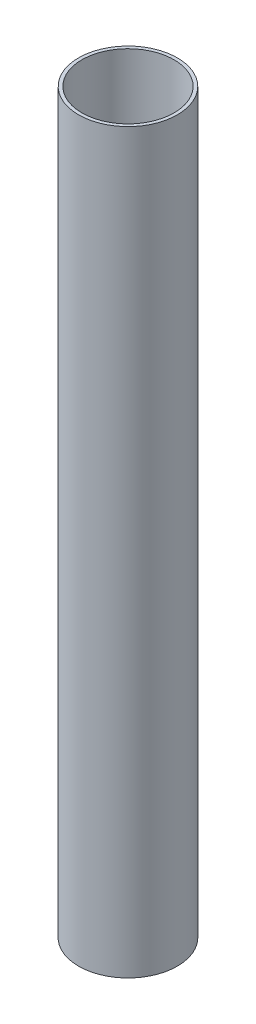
ISO-10303-21;
HEADER;
FILE_DESCRIPTION(('STEP AP214'),'2;1');
FILE_NAME('part.step','',(''),(''),'','','');
FILE_SCHEMA(('AUTOMOTIVE_DESIGN { 1 0 10303 214 1 1 1 1 }'));
ENDSEC;
DATA;
#1=APPLICATION_CONTEXT('core data for automotive mechanical design processes');
#2=APPLICATION_PROTOCOL_DEFINITION('international standard','automotive_design',2000,#1);
#3=PRODUCT_CONTEXT('',#1,'mechanical');
#4=PRODUCT('Part','Part','',(#3));
#5=PRODUCT_RELATED_PRODUCT_CATEGORY('part','',(#4));
#6=PRODUCT_DEFINITION_FORMATION('','',#4);
#7=PRODUCT_DEFINITION_CONTEXT('part definition',#1,'design');
#8=PRODUCT_DEFINITION('design','',#6,#7);
#9=PRODUCT_DEFINITION_SHAPE('','',#8);
#10=(LENGTH_UNIT() NAMED_UNIT(*) SI_UNIT(.MILLI.,.METRE.));
#11=(NAMED_UNIT(*) PLANE_ANGLE_UNIT() SI_UNIT($,.RADIAN.));
#12=(NAMED_UNIT(*) SI_UNIT($,.STERADIAN.) SOLID_ANGLE_UNIT());
#13=UNCERTAINTY_MEASURE_WITH_UNIT(LENGTH_MEASURE(1.E-05),#10,'distance_accuracy_value','');
#14=(GEOMETRIC_REPRESENTATION_CONTEXT(3) GLOBAL_UNCERTAINTY_ASSIGNED_CONTEXT((#13)) GLOBAL_UNIT_ASSIGNED_CONTEXT((#10,
#11,#12)) REPRESENTATION_CONTEXT('',''));
#15=CARTESIAN_POINT('',(0.,0.,0.));
#16=DIRECTION('',(0.,0.,1.));
#17=DIRECTION('',(1.,0.,0.));
#18=AXIS2_PLACEMENT_3D('',#15,#16,#17);
#19=CARTESIAN_POINT('',(0.,711.2,0.));
#20=DIRECTION('',(0.,1.,0.));
#21=DIRECTION('',(0.,0.,1.));
#22=AXIS2_PLACEMENT_3D('',#19,#20,#21);
#23=PLANE('',#22);
#24=CARTESIAN_POINT('',(0.,711.2,0.));
#25=DIRECTION('',(0.,1.,0.));
#26=DIRECTION('',(0.,0.,1.));
#27=AXIS2_PLACEMENT_3D('',#24,#25,#26);
#28=CIRCLE('',#27,47.625);
#29=CARTESIAN_POINT('',(0.,711.2,47.625));
#30=VERTEX_POINT('',#29);
#31=EDGE_CURVE('E10',#30,#30,#28,.T.);
#32=ORIENTED_EDGE('',*,*,#31,.T.);
#33=EDGE_LOOP('',(#32));
#34=FACE_BOUND('',#33,.T.);
#35=CARTESIAN_POINT('',(0.,711.2,0.));
#36=DIRECTION('',(0.,1.,0.));
#37=DIRECTION('',(0.,0.,1.));
#38=AXIS2_PLACEMENT_3D('',#35,#36,#37);
#39=CIRCLE('',#38,44.45);
#40=CARTESIAN_POINT('',(0.,711.2,44.45));
#41=VERTEX_POINT('',#40);
#42=EDGE_CURVE('E41',#41,#41,#39,.T.);
#43=ORIENTED_EDGE('',*,*,#42,.F.);
#44=EDGE_LOOP('',(#43));
#45=FACE_BOUND('',#44,.T.);
#46=ADVANCED_FACE('F30',(#34,#45),#23,.T.);
#47=CARTESIAN_POINT('',(0.,0.,0.));
#48=DIRECTION('',(0.,1.,0.));
#49=DIRECTION('',(0.,0.,1.));
#50=AXIS2_PLACEMENT_3D('',#47,#48,#49);
#51=PLANE('',#50);
#52=CARTESIAN_POINT('',(0.,0.,0.));
#53=DIRECTION('',(0.,1.,0.));
#54=DIRECTION('',(0.,0.,1.));
#55=AXIS2_PLACEMENT_3D('',#52,#53,#54);
#56=CIRCLE('',#55,47.625);
#57=CARTESIAN_POINT('',(0.,0.,47.625));
#58=VERTEX_POINT('',#57);
#59=EDGE_CURVE('E34',#58,#58,#56,.T.);
#60=ORIENTED_EDGE('',*,*,#59,.F.);
#61=EDGE_LOOP('',(#60));
#62=FACE_BOUND('',#61,.T.);
#63=CARTESIAN_POINT('',(0.,0.,0.));
#64=DIRECTION('',(0.,1.,0.));
#65=DIRECTION('',(0.,0.,1.));
#66=AXIS2_PLACEMENT_3D('',#63,#64,#65);
#67=CIRCLE('',#66,44.45);
#68=CARTESIAN_POINT('',(0.,0.,44.45));
#69=VERTEX_POINT('',#68);
#70=EDGE_CURVE('E43',#69,#69,#67,.T.);
#71=ORIENTED_EDGE('',*,*,#70,.T.);
#72=EDGE_LOOP('',(#71));
#73=FACE_BOUND('',#72,.T.);
#74=ADVANCED_FACE('F53',(#62,#73),#51,.F.);
#75=CARTESIAN_POINT('',(0.,711.2,0.));
#76=DIRECTION('',(0.,-1.,0.));
#77=DIRECTION('',(0.,0.,-1.));
#78=AXIS2_PLACEMENT_3D('',#75,#76,#77);
#79=CYLINDRICAL_SURFACE('',#78,47.625);
#80=ORIENTED_EDGE('',*,*,#31,.F.);
#81=EDGE_LOOP('',(#80));
#82=FACE_BOUND('',#81,.T.);
#83=ORIENTED_EDGE('',*,*,#59,.T.);
#84=EDGE_LOOP('',(#83));
#85=FACE_BOUND('',#84,.T.);
#86=ADVANCED_FACE('F32',(#82,#85),#79,.T.);
#87=CARTESIAN_POINT('',(0.,711.2,0.));
#88=DIRECTION('',(0.,-1.,0.));
#89=DIRECTION('',(0.,0.,-1.));
#90=AXIS2_PLACEMENT_3D('',#87,#88,#89);
#91=CYLINDRICAL_SURFACE('',#90,44.45);
#92=ORIENTED_EDGE('',*,*,#42,.T.);
#93=EDGE_LOOP('',(#92));
#94=FACE_BOUND('',#93,.T.);
#95=ORIENTED_EDGE('',*,*,#70,.F.);
#96=EDGE_LOOP('',(#95));
#97=FACE_BOUND('',#96,.T.);
#98=ADVANCED_FACE('F49',(#94,#97),#91,.F.);
#99=CLOSED_SHELL('',(#46,#74,#86,#98));
#100=MANIFOLD_SOLID_BREP('B2',#99);
#101=ADVANCED_BREP_SHAPE_REPRESENTATION('',(#18,#100),#14);
#102=SHAPE_DEFINITION_REPRESENTATION(#9,#101);
ENDSEC;
END-ISO-10303-21;
